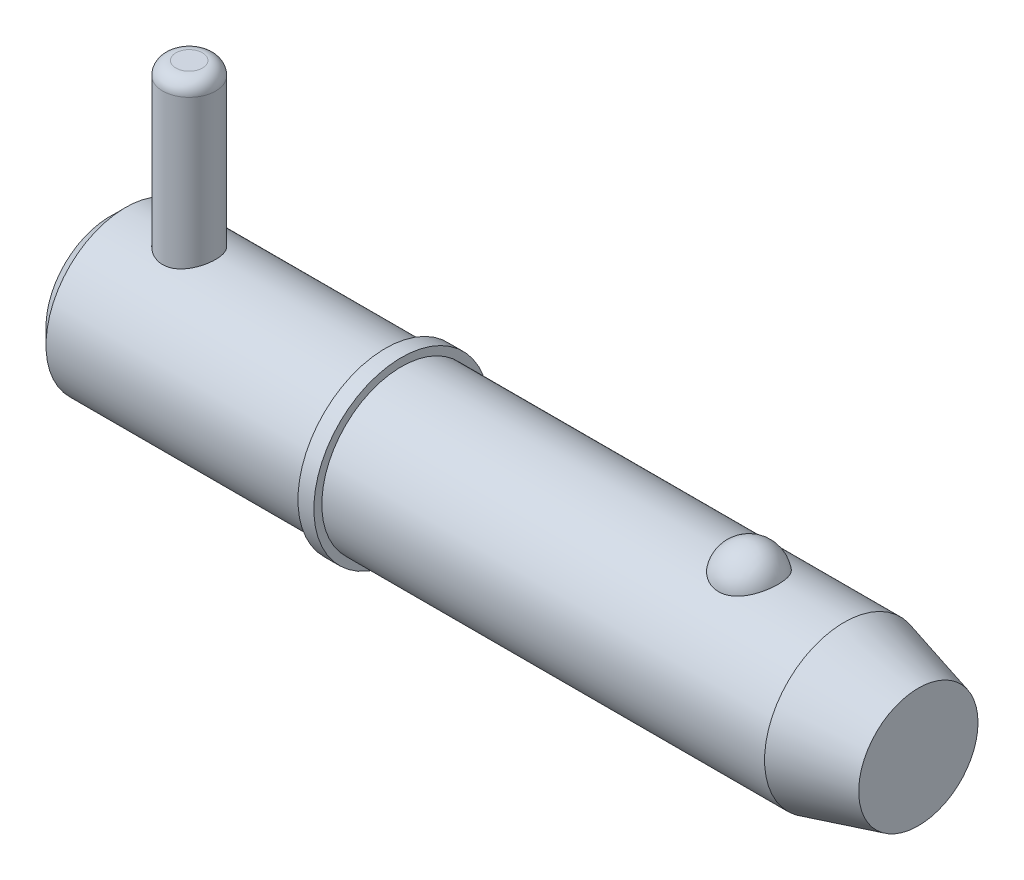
ISO-10303-21;
HEADER;
FILE_DESCRIPTION(('STEP AP214'),'2;1');
FILE_NAME('part.step','',(''),(''),'','','');
FILE_SCHEMA(('AUTOMOTIVE_DESIGN { 1 0 10303 214 1 1 1 1 }'));
ENDSEC;
DATA;
#1=APPLICATION_CONTEXT('core data for automotive mechanical design processes');
#2=APPLICATION_PROTOCOL_DEFINITION('international standard','automotive_design',2000,#1);
#3=PRODUCT_CONTEXT('',#1,'mechanical');
#4=PRODUCT('Part','Part','',(#3));
#5=PRODUCT_RELATED_PRODUCT_CATEGORY('part','',(#4));
#6=PRODUCT_DEFINITION_FORMATION('','',#4);
#7=PRODUCT_DEFINITION_CONTEXT('part definition',#1,'design');
#8=PRODUCT_DEFINITION('design','',#6,#7);
#9=PRODUCT_DEFINITION_SHAPE('','',#8);
#10=(LENGTH_UNIT() NAMED_UNIT(*) SI_UNIT(.MILLI.,.METRE.));
#11=(NAMED_UNIT(*) PLANE_ANGLE_UNIT() SI_UNIT($,.RADIAN.));
#12=(NAMED_UNIT(*) SI_UNIT($,.STERADIAN.) SOLID_ANGLE_UNIT());
#13=UNCERTAINTY_MEASURE_WITH_UNIT(LENGTH_MEASURE(1.E-05),#10,'distance_accuracy_value','');
#14=(GEOMETRIC_REPRESENTATION_CONTEXT(3) GLOBAL_UNCERTAINTY_ASSIGNED_CONTEXT((#13)) GLOBAL_UNIT_ASSIGNED_CONTEXT((#10,
#11,#12)) REPRESENTATION_CONTEXT('',''));
#15=CARTESIAN_POINT('',(0.,0.,0.));
#16=DIRECTION('',(0.,0.,1.));
#17=DIRECTION('',(1.,0.,0.));
#18=AXIS2_PLACEMENT_3D('',#15,#16,#17);
#19=CARTESIAN_POINT('',(9.52500000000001,28.575,0.));
#20=DIRECTION('',(0.,-1.,0.));
#21=DIRECTION('',(0.,0.,-1.));
#22=AXIS2_PLACEMENT_3D('',#19,#20,#21);
#23=CYLINDRICAL_SURFACE('',#22,3.175);
#24=CARTESIAN_POINT('',(9.52500000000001,-7.93750000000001,0.));
#25=DIRECTION('',(0.,1.,0.));
#26=DIRECTION('',(0.,0.,1.));
#27=AXIS2_PLACEMENT_3D('',#24,#25,#26);
#28=CIRCLE('',#27,3.175);
#29=CARTESIAN_POINT('',(9.52500000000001,-7.93750000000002,-3.175));
#30=VERTEX_POINT('',#29);
#31=EDGE_CURVE('P0_E25',#30,#30,#28,.T.);
#32=CARTESIAN_POINT('',(9.52500000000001,26.9875,0.));
#33=DIRECTION('',(0.,1.,0.));
#34=DIRECTION('',(0.,0.,1.));
#35=AXIS2_PLACEMENT_3D('',#32,#33,#34);
#36=CIRCLE('',#35,3.175);
#37=CARTESIAN_POINT('',(9.52500000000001,26.9875,-3.175));
#38=VERTEX_POINT('',#37);
#39=EDGE_CURVE('P0_E29',#38,#38,#36,.F.);
#40=CARTESIAN_POINT('',(9.52500000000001,-7.93750000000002,-3.175));
#41=CARTESIAN_POINT('',(9.52500000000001,-7.57369791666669,-3.175));
#42=CARTESIAN_POINT('',(9.52500000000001,-7.20989583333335,-3.175));
#43=CARTESIAN_POINT('',(9.52500000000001,-6.48229166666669,-3.175));
#44=CARTESIAN_POINT('',(9.52500000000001,-6.11848958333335,-3.175));
#45=CARTESIAN_POINT('',(9.52500000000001,-5.39088541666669,-3.175));
#46=CARTESIAN_POINT('',(9.52500000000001,-5.02708333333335,-3.175));
#47=CARTESIAN_POINT('',(9.52500000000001,-4.29947916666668,-3.175));
#48=CARTESIAN_POINT('',(9.52500000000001,-3.93567708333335,-3.175));
#49=CARTESIAN_POINT('',(9.52500000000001,-3.20807291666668,-3.175));
#50=CARTESIAN_POINT('',(9.52500000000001,-2.84427083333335,-3.175));
#51=CARTESIAN_POINT('',(9.52500000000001,-2.11666666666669,-3.175));
#52=CARTESIAN_POINT('',(9.52500000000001,-1.75286458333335,-3.175));
#53=CARTESIAN_POINT('',(9.52500000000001,-1.02526041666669,-3.175));
#54=CARTESIAN_POINT('',(9.52500000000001,-0.661458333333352,-3.175));
#55=CARTESIAN_POINT('',(9.52500000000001,0.0661458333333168,-3.175));
#56=CARTESIAN_POINT('',(9.52500000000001,0.429947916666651,-3.175));
#57=CARTESIAN_POINT('',(9.52500000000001,1.15755208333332,-3.175));
#58=CARTESIAN_POINT('',(9.52500000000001,1.52135416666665,-3.175));
#59=CARTESIAN_POINT('',(9.52500000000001,2.24895833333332,-3.175));
#60=CARTESIAN_POINT('',(9.52500000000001,2.61276041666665,-3.175));
#61=CARTESIAN_POINT('',(9.52500000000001,3.34036458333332,-3.175));
#62=CARTESIAN_POINT('',(9.52500000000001,3.70416666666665,-3.175));
#63=CARTESIAN_POINT('',(9.52500000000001,4.43177083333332,-3.175));
#64=CARTESIAN_POINT('',(9.52500000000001,4.79557291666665,-3.175));
#65=CARTESIAN_POINT('',(9.52500000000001,5.52317708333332,-3.175));
#66=CARTESIAN_POINT('',(9.52500000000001,5.88697916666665,-3.175));
#67=CARTESIAN_POINT('',(9.52500000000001,6.61458333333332,-3.175));
#68=CARTESIAN_POINT('',(9.52500000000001,6.97838541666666,-3.175));
#69=CARTESIAN_POINT('',(9.52500000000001,7.70598958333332,-3.175));
#70=CARTESIAN_POINT('',(9.52500000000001,8.06979166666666,-3.175));
#71=CARTESIAN_POINT('',(9.52500000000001,8.79739583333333,-3.175));
#72=CARTESIAN_POINT('',(9.52500000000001,9.16119791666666,-3.175));
#73=CARTESIAN_POINT('',(9.52500000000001,9.88880208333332,-3.175));
#74=CARTESIAN_POINT('',(9.52500000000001,10.2526041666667,-3.175));
#75=CARTESIAN_POINT('',(9.52500000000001,10.9802083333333,-3.175));
#76=CARTESIAN_POINT('',(9.52500000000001,11.3440104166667,-3.175));
#77=CARTESIAN_POINT('',(9.52500000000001,12.0716145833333,-3.175));
#78=CARTESIAN_POINT('',(9.52500000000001,12.4354166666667,-3.175));
#79=CARTESIAN_POINT('',(9.52500000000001,13.1630208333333,-3.175));
#80=CARTESIAN_POINT('',(9.52500000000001,13.5268229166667,-3.175));
#81=CARTESIAN_POINT('',(9.52500000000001,14.2544270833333,-3.175));
#82=CARTESIAN_POINT('',(9.52500000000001,14.6182291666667,-3.175));
#83=CARTESIAN_POINT('',(9.52500000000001,15.3458333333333,-3.175));
#84=CARTESIAN_POINT('',(9.52500000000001,15.7096354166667,-3.175));
#85=CARTESIAN_POINT('',(9.52500000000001,16.4372395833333,-3.175));
#86=CARTESIAN_POINT('',(9.52500000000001,16.8010416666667,-3.175));
#87=CARTESIAN_POINT('',(9.52500000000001,17.5286458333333,-3.175));
#88=CARTESIAN_POINT('',(9.52500000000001,17.8924479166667,-3.175));
#89=CARTESIAN_POINT('',(9.52500000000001,18.6200520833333,-3.175));
#90=CARTESIAN_POINT('',(9.52500000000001,18.9838541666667,-3.175));
#91=CARTESIAN_POINT('',(9.52500000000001,19.7114583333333,-3.175));
#92=CARTESIAN_POINT('',(9.52500000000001,20.0752604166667,-3.175));
#93=CARTESIAN_POINT('',(9.52500000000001,20.8028645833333,-3.175));
#94=CARTESIAN_POINT('',(9.52500000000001,21.1666666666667,-3.175));
#95=CARTESIAN_POINT('',(9.52500000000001,21.8942708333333,-3.175));
#96=CARTESIAN_POINT('',(9.52500000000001,22.2580729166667,-3.175));
#97=CARTESIAN_POINT('',(9.52500000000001,22.9856770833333,-3.175));
#98=CARTESIAN_POINT('',(9.52500000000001,23.3494791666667,-3.175));
#99=CARTESIAN_POINT('',(9.52500000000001,24.0770833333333,-3.175));
#100=CARTESIAN_POINT('',(9.52500000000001,24.4408854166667,-3.175));
#101=CARTESIAN_POINT('',(9.52500000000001,25.1684895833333,-3.175));
#102=CARTESIAN_POINT('',(9.52500000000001,25.5322916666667,-3.175));
#103=CARTESIAN_POINT('',(9.52500000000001,26.2598958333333,-3.175));
#104=CARTESIAN_POINT('',(9.52500000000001,26.6236979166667,-3.175));
#105=CARTESIAN_POINT('',(9.52500000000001,26.9875,-3.175));
#106=B_SPLINE_CURVE_WITH_KNOTS('',3,(#40,#41,#42,#43,#44,#45,#46,#47,#48,#49,#50,#51,#52,#53,
#54,#55,#56,#57,#58,#59,#60,#61,#62,#63,#64,#65,#66,#67,#68,#69,#70,#71,#72,#73,#74,#75,#76,#77,
#78,#79,#80,#81,#82,#83,#84,#85,#86,#87,#88,#89,#90,#91,#92,#93,#94,#95,#96,#97,#98,#99,#100,
#101,#102,#103,#104,#105),.UNSPECIFIED.,.F.,.F.,(4,2,2,2,2,2,2,2,2,2,2,2,2,2,2,2,2,2,2,2,2,2,2,
2,2,2,2,2,2,2,2,2,4),(0.,1.09140625,2.1828125,3.27421875,4.365625,5.45703125,6.5484375,
7.63984375,8.73125000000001,9.82265625,10.9140625,12.00546875,13.096875,14.18828125,15.2796875,
16.37109375,17.4625,18.55390625,19.6453125,20.73671875,21.828125,22.91953125,24.0109375,
25.10234375,26.19375,27.28515625,28.3765625,29.46796875,30.559375,31.65078125,32.7421875,
33.83359375,34.925),.UNSPECIFIED.);
#107=EDGE_CURVE('P0_BSEAM14',#30,#38,#106,.T.);
#108=ORIENTED_EDGE('',*,*,#31,.T.);
#109=ORIENTED_EDGE('',*,*,#39,.T.);
#110=ORIENTED_EDGE('',*,*,#107,.T.);
#111=ORIENTED_EDGE('',*,*,#107,.F.);
#112=EDGE_LOOP('',(#108,#110,#109,#111));
#113=FACE_BOUND('',#112,.T.);
#114=ADVANCED_FACE('P0_F14',(#113),#23,.T.);
#115=CARTESIAN_POINT('',(9.52500000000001,28.575,0.));
#116=DIRECTION('',(0.,1.,0.));
#117=DIRECTION('',(0.,0.,1.));
#118=AXIS2_PLACEMENT_3D('',#115,#116,#117);
#119=PLANE('',#118);
#120=CARTESIAN_POINT('',(9.52500000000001,28.575,0.));
#121=DIRECTION('',(0.,1.,0.));
#122=DIRECTION('',(0.,0.,1.));
#123=AXIS2_PLACEMENT_3D('',#120,#121,#122);
#124=CIRCLE('',#123,1.5875);
#125=CARTESIAN_POINT('',(9.52500000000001,28.575,1.5875));
#126=VERTEX_POINT('',#125);
#127=EDGE_CURVE('P0_E10',#126,#126,#124,.T.);
#128=ORIENTED_EDGE('',*,*,#127,.T.);
#129=EDGE_LOOP('',(#128));
#130=FACE_BOUND('',#129,.T.);
#131=ADVANCED_FACE('P0_F46',(#130),#119,.T.);
#132=CARTESIAN_POINT('',(9.52500000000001,-9.525,0.));
#133=DIRECTION('',(0.,1.,0.));
#134=DIRECTION('',(0.,0.,1.));
#135=AXIS2_PLACEMENT_3D('',#132,#133,#134);
#136=PLANE('',#135);
#137=CARTESIAN_POINT('',(9.52500000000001,-9.525,0.));
#138=DIRECTION('',(0.,1.,0.));
#139=DIRECTION('',(0.,0.,1.));
#140=AXIS2_PLACEMENT_3D('',#137,#138,#139);
#141=CIRCLE('',#140,1.5875);
#142=CARTESIAN_POINT('',(9.52500000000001,-9.525,1.5875));
#143=VERTEX_POINT('',#142);
#144=EDGE_CURVE('P0_E21',#143,#143,#141,.F.);
#145=ORIENTED_EDGE('',*,*,#144,.T.);
#146=EDGE_LOOP('',(#145));
#147=FACE_BOUND('',#146,.T.);
#148=ADVANCED_FACE('P0_F43',(#147),#136,.F.);
#149=CARTESIAN_POINT('',(9.52500000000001,-7.9375,0.));
#150=DIRECTION('',(0.,1.,0.));
#151=DIRECTION('',(0.,0.,1.));
#152=AXIS2_PLACEMENT_3D('',#149,#150,#151);
#153=DEGENERATE_TOROIDAL_SURFACE('',#152,1.5875,1.5875,.T.);
#154=ORIENTED_EDGE('',*,*,#144,.F.);
#155=EDGE_LOOP('',(#154));
#156=FACE_BOUND('',#155,.T.);
#157=ORIENTED_EDGE('',*,*,#31,.F.);
#158=EDGE_LOOP('',(#157));
#159=FACE_BOUND('',#158,.T.);
#160=ADVANCED_FACE('P0_F38',(#156,#159),#153,.T.);
#161=CARTESIAN_POINT('',(9.52500000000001,26.9875,0.));
#162=DIRECTION('',(0.,1.,0.));
#163=DIRECTION('',(0.,0.,1.));
#164=AXIS2_PLACEMENT_3D('',#161,#162,#163);
#165=DEGENERATE_TOROIDAL_SURFACE('',#164,1.5875,1.5875,.T.);
#166=ORIENTED_EDGE('',*,*,#39,.F.);
#167=EDGE_LOOP('',(#166));
#168=FACE_BOUND('',#167,.T.);
#169=ORIENTED_EDGE('',*,*,#127,.F.);
#170=EDGE_LOOP('',(#169));
#171=FACE_BOUND('',#170,.T.);
#172=ADVANCED_FACE('P0_F16',(#168,#171),#165,.T.);
#173=CLOSED_SHELL('',(#114,#131,#148,#160,#172));
#174=MANIFOLD_SOLID_BREP('P0_B1',#173);
#175=CARTESIAN_POINT('',(0.,0.,0.));
#176=DIRECTION('',(1.,0.,0.));
#177=DIRECTION('',(0.,0.,-1.));
#178=AXIS2_PLACEMENT_3D('',#175,#176,#177);
#179=CYLINDRICAL_SURFACE('',#178,9.525);
#180=CARTESIAN_POINT('',(87.9430540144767,0.,0.));
#181=DIRECTION('',(1.,0.,0.));
#182=DIRECTION('',(0.,0.,-1.));
#183=AXIS2_PLACEMENT_3D('',#180,#181,#182);
#184=CIRCLE('',#183,9.525);
#185=CARTESIAN_POINT('',(87.9430540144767,0.,-9.525));
#186=VERTEX_POINT('',#185);
#187=EDGE_CURVE('P1_E81',#186,#186,#184,.T.);
#188=ORIENTED_EDGE('',*,*,#187,.F.);
#189=EDGE_LOOP('',(#188));
#190=FACE_BOUND('',#189,.T.);
#191=CARTESIAN_POINT('',(34.93,0.,0.));
#192=DIRECTION('',(1.,0.,0.));
#193=DIRECTION('',(0.,0.,-1.));
#194=AXIS2_PLACEMENT_3D('',#191,#192,#193);
#195=CIRCLE('',#194,9.525);
#196=CARTESIAN_POINT('',(34.93,0.,-9.525));
#197=VERTEX_POINT('',#196);
#198=EDGE_CURVE('P1_E85',#197,#197,#195,.T.);
#199=ORIENTED_EDGE('',*,*,#198,.T.);
#200=EDGE_LOOP('',(#199));
#201=FACE_BOUND('',#200,.T.);
#202=CARTESIAN_POINT('',(76.5457573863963,8.80405803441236,3.63513233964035));
#203=CARTESIAN_POINT('',(76.4516766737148,8.80405953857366,3.63513053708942));
#204=CARTESIAN_POINT('',(76.3575618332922,8.80561325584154,3.6313746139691));
#205=CARTESIAN_POINT('',(76.1700126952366,8.81177748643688,3.61638665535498));
#206=CARTESIAN_POINT('',(76.0765788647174,8.81638992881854,3.60514990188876));
#207=CARTESIAN_POINT('',(75.7979452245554,8.8346711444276,3.56024627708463));
#208=CARTESIAN_POINT('',(75.6146916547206,8.85278327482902,3.51538626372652));
#209=CARTESIAN_POINT('',(75.259509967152,8.89871214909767,3.39742145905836));
#210=CARTESIAN_POINT('',(75.0875533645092,8.92650327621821,3.32439116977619));
#211=CARTESIAN_POINT('',(74.758707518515,8.98874819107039,3.15220244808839));
#212=CARTESIAN_POINT('',(74.6018114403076,9.02319893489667,3.05305594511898));
#213=CARTESIAN_POINT('',(74.3022147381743,9.09629186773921,2.82797815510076));
#214=CARTESIAN_POINT('',(74.1600600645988,9.13502685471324,2.7013513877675));
#215=CARTESIAN_POINT('',(73.8982999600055,9.2118657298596,2.4264193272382));
#216=CARTESIAN_POINT('',(73.7787015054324,9.2499694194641,2.27810735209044));
#217=CARTESIAN_POINT('',(73.559645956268,9.3234108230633,1.95652290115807));
#218=CARTESIAN_POINT('',(73.4613174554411,9.35855090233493,1.78243511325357));
#219=CARTESIAN_POINT('',(73.2938190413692,9.42045142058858,1.41937246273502));
#220=CARTESIAN_POINT('',(73.2246511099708,9.44721128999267,1.23039658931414));
#221=CARTESIAN_POINT('',(73.1161994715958,9.48990641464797,0.840370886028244));
#222=CARTESIAN_POINT('',(73.0772880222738,9.50570658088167,0.639202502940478));
#223=CARTESIAN_POINT('',(73.0315550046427,9.52433146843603,0.232664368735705));
#224=CARTESIAN_POINT('',(73.0247324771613,9.52715657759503,0.0272947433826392));
#225=CARTESIAN_POINT('',(73.043255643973,9.51956918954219,-0.380478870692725));
#226=CARTESIAN_POINT('',(73.0684052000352,9.50923740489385,-0.582893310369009));
#227=CARTESIAN_POINT('',(73.1500253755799,9.47651897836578,-0.980293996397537));
#228=CARTESIAN_POINT('',(73.2064966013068,9.45413210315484,-1.17528009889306));
#229=CARTESIAN_POINT('',(73.3497192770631,9.39954044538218,-1.55263697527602));
#230=CARTESIAN_POINT('',(73.4365124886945,9.36732213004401,-1.73498993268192));
#231=CARTESIAN_POINT('',(73.6386103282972,9.29640700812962,-2.08177763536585));
#232=CARTESIAN_POINT('',(73.7539172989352,9.25770966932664,-2.24621090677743));
#233=CARTESIAN_POINT('',(74.011264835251,9.17775604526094,-2.5533833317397));
#234=CARTESIAN_POINT('',(74.1534344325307,9.136488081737,-2.696011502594));
#235=CARTESIAN_POINT('',(74.46089985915,9.05620497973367,-2.95451229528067));
#236=CARTESIAN_POINT('',(74.626193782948,9.01718965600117,-3.07038711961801));
#237=CARTESIAN_POINT('',(74.972052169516,8.9468001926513,-3.26976836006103));
#238=CARTESIAN_POINT('',(75.1522278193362,8.91528408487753,-3.35389750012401));
#239=CARTESIAN_POINT('',(75.5256514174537,8.86272514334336,-3.49043503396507));
#240=CARTESIAN_POINT('',(75.7188944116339,8.8416783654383,-3.54285537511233));
#241=CARTESIAN_POINT('',(76.1025036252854,8.81348056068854,-3.61241306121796));
#242=CARTESIAN_POINT('',(76.2925251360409,8.80568348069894,-3.63119339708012));
#243=CARTESIAN_POINT('',(76.6731906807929,8.80289410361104,-3.63795342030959));
#244=CARTESIAN_POINT('',(76.8638345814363,8.80789922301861,-3.62593932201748));
#245=CARTESIAN_POINT('',(77.234007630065,8.8297491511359,-3.57238430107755));
#246=CARTESIAN_POINT('',(77.4136976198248,8.84621463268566,-3.53178890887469));
#247=CARTESIAN_POINT('',(77.763422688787,8.88875330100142,-3.42331083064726));
#248=CARTESIAN_POINT('',(77.9334569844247,8.91482726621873,-3.35542593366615));
#249=CARTESIAN_POINT('',(78.2632377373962,8.97448239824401,-3.19248225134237));
#250=CARTESIAN_POINT('',(78.4226801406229,9.00821446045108,-3.09686474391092));
#251=CARTESIAN_POINT('',(78.7235136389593,9.07935398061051,-2.88162736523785));
#252=CARTESIAN_POINT('',(78.8649005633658,9.11676228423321,-2.76200196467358));
#253=CARTESIAN_POINT('',(79.1333193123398,9.19347419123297,-2.49516285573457));
#254=CARTESIAN_POINT('',(79.2592750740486,9.23277872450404,-2.34686614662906));
#255=CARTESIAN_POINT('',(79.4855227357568,9.30737610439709,-2.03093683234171));
#256=CARTESIAN_POINT('',(79.5858100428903,9.34266823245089,-1.86330077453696));
#257=CARTESIAN_POINT('',(79.7615149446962,9.40674710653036,-1.50744893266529));
#258=CARTESIAN_POINT('',(79.836041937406,9.4352917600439,-1.31874876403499));
#259=CARTESIAN_POINT('',(79.9541650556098,9.48144132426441,-0.930631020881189));
#260=CARTESIAN_POINT('',(79.9977608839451,9.49904612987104,-0.731213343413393));
#261=CARTESIAN_POINT('',(80.0531580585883,9.5215314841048,-0.327147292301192));
#262=CARTESIAN_POINT('',(80.0649354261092,9.52640243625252,-0.122495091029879));
#263=CARTESIAN_POINT('',(80.0563825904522,9.52289571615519,0.286018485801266));
#264=CARTESIAN_POINT('',(80.0360530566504,9.51451832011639,0.489879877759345));
#265=CARTESIAN_POINT('',(79.9638840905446,9.48544083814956,0.889994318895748));
#266=CARTESIAN_POINT('',(79.9121993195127,9.46480124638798,1.08627971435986));
#267=CARTESIAN_POINT('',(79.7784917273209,9.41333895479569,1.46682086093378));
#268=CARTESIAN_POINT('',(79.6964668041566,9.38251554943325,1.65107577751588));
#269=CARTESIAN_POINT('',(79.5031929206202,9.31365636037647,2.00346348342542));
#270=CARTESIAN_POINT('',(79.3917838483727,9.27558138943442,2.17150083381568));
#271=CARTESIAN_POINT('',(79.1422947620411,9.19638714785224,2.48563115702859));
#272=CARTESIAN_POINT('',(79.0042163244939,9.15526805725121,2.63172542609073));
#273=CARTESIAN_POINT('',(78.7048438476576,9.07465393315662,2.89750997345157));
#274=CARTESIAN_POINT('',(78.5436109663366,9.03515496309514,3.01726776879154));
#275=CARTESIAN_POINT('',(78.2016136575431,8.96227564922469,3.22732920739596));
#276=CARTESIAN_POINT('',(78.020841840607,8.92889763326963,3.31762165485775));
#277=CARTESIAN_POINT('',(77.6514451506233,8.8734538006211,3.46314419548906));
#278=CARTESIAN_POINT('',(77.4633237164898,8.85102983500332,3.51950082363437));
#279=CARTESIAN_POINT('',(77.1757869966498,8.8266696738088,3.57993683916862));
#280=CARTESIAN_POINT('',(77.0791339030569,8.82009725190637,3.59606217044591));
#281=CARTESIAN_POINT('',(76.8846770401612,8.81020897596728,3.62022512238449));
#282=CARTESIAN_POINT('',(76.7868741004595,8.80689090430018,3.62826825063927));
#283=CARTESIAN_POINT('',(76.6412243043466,8.80445615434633,3.63416760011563));
#284=CARTESIAN_POINT('',(76.5934952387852,8.80405727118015,3.63513325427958));
#285=CARTESIAN_POINT('',(76.5457573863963,8.80405803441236,3.63513233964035));
#286=B_SPLINE_CURVE_WITH_KNOTS('',3,(#202,#203,#204,#205,#206,#207,#208,#209,#210,#211,#212,
#213,#214,#215,#216,#217,#218,#219,#220,#221,#222,#223,#224,#225,#226,#227,#228,#229,#230,#231,
#232,#233,#234,#235,#236,#237,#238,#239,#240,#241,#242,#243,#244,#245,#246,#247,#248,#249,#250,
#251,#252,#253,#254,#255,#256,#257,#258,#259,#260,#261,#262,#263,#264,#265,#266,#267,#268,#269,
#270,#271,#272,#273,#274,#275,#276,#277,#278,#279,#280,#281,#282,#283,#284,#285),.UNSPECIFIED.,
.T.,.F.,(4,2,2,2,2,2,2,2,2,2,2,2,2,2,2,2,2,2,2,2,2,2,2,2,2,2,2,2,2,2,2,2,2,2,2,2,2,2,2,2,2,4),
(0.,0.282202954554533,0.564584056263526,1.13017050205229,1.69427128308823,2.258114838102,
2.83836627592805,3.41879688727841,4.02497117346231,4.63118665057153,5.24474754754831,
5.85829010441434,6.46808687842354,7.07789545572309,7.68854723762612,8.29924920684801,
8.91296283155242,9.52662591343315,10.1275338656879,10.7282152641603,11.2986646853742,
11.868998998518,12.4213015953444,12.973648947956,13.5380053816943,14.1024919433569,
14.695298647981,15.2882113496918,15.8999469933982,16.5116885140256,17.1238909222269,
17.7360805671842,18.3452748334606,18.9545113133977,19.567138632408,20.1797297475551,
20.7907316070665,21.4019653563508,21.9915938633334,22.2859053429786,22.5800161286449,
22.723209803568),.UNSPECIFIED.);
#287=CARTESIAN_POINT('',(76.5457573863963,8.80405803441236,3.63513233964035));
#288=VERTEX_POINT('',#287);
#289=EDGE_CURVE('P1_E35',#288,#288,#286,.T.);
#290=ORIENTED_EDGE('',*,*,#289,.T.);
#291=EDGE_LOOP('',(#290));
#292=FACE_BOUND('',#291,.T.);
#293=ADVANCED_FACE('P1_F13',(#190,#201,#292),#179,.T.);
#294=CARTESIAN_POINT('',(0.,0.,0.));
#295=DIRECTION('',(-1.,0.,0.));
#296=DIRECTION('',(0.,0.,1.));
#297=AXIS2_PLACEMENT_3D('',#294,#295,#296);
#298=PLANE('',#297);
#299=CARTESIAN_POINT('',(0.,0.,0.));
#300=DIRECTION('',(1.,0.,0.));
#301=DIRECTION('',(0.,0.,-1.));
#302=AXIS2_PLACEMENT_3D('',#299,#300,#301);
#303=CIRCLE('',#302,7.62);
#304=CARTESIAN_POINT('',(0.,0.,-7.62));
#305=VERTEX_POINT('',#304);
#306=EDGE_CURVE('P1_E9',#305,#305,#303,.T.);
#307=ORIENTED_EDGE('',*,*,#306,.F.);
#308=EDGE_LOOP('',(#307));
#309=FACE_BOUND('',#308,.T.);
#310=ADVANCED_FACE('P1_F15',(#309),#298,.T.);
#311=CARTESIAN_POINT('',(1.90499999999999,0.,0.));
#312=DIRECTION('',(1.,0.,0.));
#313=DIRECTION('',(0.,0.,-1.));
#314=AXIS2_PLACEMENT_3D('',#311,#312,#313);
#315=CONICAL_SURFACE('',#314,9.525,0.785398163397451);
#316=ORIENTED_EDGE('',*,*,#306,.T.);
#317=EDGE_LOOP('',(#316));
#318=FACE_BOUND('',#317,.T.);
#319=CARTESIAN_POINT('',(1.90499999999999,0.,0.));
#320=DIRECTION('',(1.,0.,0.));
#321=DIRECTION('',(0.,0.,-1.));
#322=AXIS2_PLACEMENT_3D('',#319,#320,#321);
#323=CIRCLE('',#322,9.525);
#324=CARTESIAN_POINT('',(1.90499999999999,0.,-9.525));
#325=VERTEX_POINT('',#324);
#326=EDGE_CURVE('P1_E26',#325,#325,#323,.T.);
#327=ORIENTED_EDGE('',*,*,#326,.F.);
#328=EDGE_LOOP('',(#327));
#329=FACE_BOUND('',#328,.T.);
#330=ADVANCED_FACE('P1_F77',(#318,#329),#315,.T.);
#331=CARTESIAN_POINT('',(0.,0.,0.));
#332=DIRECTION('',(1.,0.,0.));
#333=DIRECTION('',(0.,0.,-1.));
#334=AXIS2_PLACEMENT_3D('',#331,#332,#333);
#335=CYLINDRICAL_SURFACE('',#334,9.525);
#336=CARTESIAN_POINT('',(9.525,-8.98025612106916,3.175));
#337=CARTESIAN_POINT('',(9.35206354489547,-8.98025555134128,3.17500081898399));
#338=CARTESIAN_POINT('',(9.17913201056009,-8.98530617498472,3.16082293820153));
#339=CARTESIAN_POINT('',(8.83839221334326,-9.00485797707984,3.10467734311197));
#340=CARTESIAN_POINT('',(8.67058479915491,-9.0193607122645,3.06270505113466));
#341=CARTESIAN_POINT('',(8.34508461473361,-9.05599546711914,2.95260866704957));
#342=CARTESIAN_POINT('',(8.18737272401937,-9.07811252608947,2.88453582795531));
#343=CARTESIAN_POINT('',(7.88555684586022,-9.12746212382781,2.72434567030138));
#344=CARTESIAN_POINT('',(7.74145587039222,-9.1546957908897,2.63222304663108));
#345=CARTESIAN_POINT('',(7.46531411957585,-9.21240503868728,2.42268738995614));
#346=CARTESIAN_POINT('',(7.33388351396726,-9.24296141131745,2.30449228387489));
#347=CARTESIAN_POINT('',(7.09229340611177,-9.30319020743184,2.0478358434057));
#348=CARTESIAN_POINT('',(6.98213731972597,-9.33286248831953,1.90937126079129));
#349=CARTESIAN_POINT('',(6.78345450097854,-9.38891527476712,1.61164431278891));
#350=CARTESIAN_POINT('',(6.69556709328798,-9.41518969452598,1.45193356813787));
#351=CARTESIAN_POINT('',(6.54814671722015,-9.46053437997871,1.11896913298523));
#352=CARTESIAN_POINT('',(6.48860610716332,-9.47960658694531,0.945719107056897));
#353=CARTESIAN_POINT('',(6.40163866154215,-9.50782564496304,0.596991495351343));
#354=CARTESIAN_POINT('',(6.373166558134,-9.5172947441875,0.421801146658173));
#355=CARTESIAN_POINT('',(6.3458207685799,-9.52638456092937,0.068890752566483));
#356=CARTESIAN_POINT('',(6.34693945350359,-9.52600781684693,-0.108828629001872));
#357=CARTESIAN_POINT('',(6.37808050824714,-9.51566675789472,-0.454353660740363));
#358=CARTESIAN_POINT('',(6.4069675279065,-9.50607905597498,-0.622274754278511));
#359=CARTESIAN_POINT('',(6.490947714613,-9.47886621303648,-0.950732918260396));
#360=CARTESIAN_POINT('',(6.54604265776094,-9.46124052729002,-1.11126948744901));
#361=CARTESIAN_POINT('',(6.68153768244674,-9.41945253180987,-1.42288410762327));
#362=CARTESIAN_POINT('',(6.76226085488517,-9.3952073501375,-1.57381010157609));
#363=CARTESIAN_POINT('',(6.94645456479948,-9.34270397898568,-1.86030973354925));
#364=CARTESIAN_POINT('',(7.04993142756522,-9.31444467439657,-1.99587908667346));
#365=CARTESIAN_POINT('',(7.28241619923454,-9.25532159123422,-2.2545702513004));
#366=CARTESIAN_POINT('',(7.4123967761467,-9.22439783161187,-2.37680549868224));
#367=CARTESIAN_POINT('',(7.69127470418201,-9.1645528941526,-2.5980302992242));
#368=CARTESIAN_POINT('',(7.84017496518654,-9.13563202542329,-2.6970162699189));
#369=CARTESIAN_POINT('',(8.15547526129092,-9.08273917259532,-2.87016016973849));
#370=CARTESIAN_POINT('',(8.32209451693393,-9.05884361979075,-2.94394402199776));
#371=CARTESIAN_POINT('',(8.66638917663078,-9.01959241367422,-3.06210713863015));
#372=CARTESIAN_POINT('',(8.84405991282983,-9.00423318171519,-3.10649872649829));
#373=CARTESIAN_POINT('',(9.19682677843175,-8.98460345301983,-3.16281207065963));
#374=CARTESIAN_POINT('',(9.37167742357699,-8.9798639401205,-3.17610837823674));
#375=CARTESIAN_POINT('',(9.72113927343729,-8.9806993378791,-3.17374726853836));
#376=CARTESIAN_POINT('',(9.89575051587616,-8.98627237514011,-3.15809511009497));
#377=CARTESIAN_POINT('',(10.2335233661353,-9.00663737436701,-3.09951644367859));
#378=CARTESIAN_POINT('',(10.3968722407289,-9.02110608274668,-3.05754530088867));
#379=CARTESIAN_POINT('',(10.7141759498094,-9.05727657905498,-2.94866651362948));
#380=CARTESIAN_POINT('',(10.8681291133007,-9.07897964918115,-2.88175444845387));
#381=CARTESIAN_POINT('',(11.1676828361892,-9.12802586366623,-2.72248103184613));
#382=CARTESIAN_POINT('',(11.3128635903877,-9.1555260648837,-2.62937980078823));
#383=CARTESIAN_POINT('',(11.5860387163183,-9.21276315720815,-2.42120937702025));
#384=CARTESIAN_POINT('',(11.7140280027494,-9.24250070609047,-2.30613370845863));
#385=CARTESIAN_POINT('',(11.9555513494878,-9.30259247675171,-2.05070616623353));
#386=CARTESIAN_POINT('',(12.0680936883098,-9.33290753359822,-1.90940458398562));
#387=CARTESIAN_POINT('',(12.267933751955,-9.3893275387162,-1.60917665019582));
#388=CARTESIAN_POINT('',(12.3552323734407,-9.41543263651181,-1.45025092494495));
#389=CARTESIAN_POINT('',(12.5013088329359,-9.46036988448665,-1.12007606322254));
#390=CARTESIAN_POINT('',(12.5602723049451,-9.47924920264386,-0.9489158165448));
#391=CARTESIAN_POINT('',(12.6483355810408,-9.50781089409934,-0.598355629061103));
#392=CARTESIAN_POINT('',(12.6774461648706,-9.5174965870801,-0.4189586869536));
#393=CARTESIAN_POINT('',(12.7040070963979,-9.52632915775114,-0.066088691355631));
#394=CARTESIAN_POINT('',(12.7028811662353,-9.52594996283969,0.107266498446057));
#395=CARTESIAN_POINT('',(12.6725130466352,-9.51586223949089,0.451202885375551));
#396=CARTESIAN_POINT('',(12.643273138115,-9.50615446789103,0.621784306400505));
#397=CARTESIAN_POINT('',(12.5584514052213,-9.47867404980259,0.952633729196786));
#398=CARTESIAN_POINT('',(12.5032953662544,-9.46103195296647,1.1130225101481));
#399=CARTESIAN_POINT('',(12.3686013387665,-9.41949985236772,1.42233126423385));
#400=CARTESIAN_POINT('',(12.2890589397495,-9.39560871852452,1.57124915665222));
#401=CARTESIAN_POINT('',(12.1044667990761,-9.34294133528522,1.85938800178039));
#402=CARTESIAN_POINT('',(11.9985831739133,-9.31401720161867,1.9980473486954));
#403=CARTESIAN_POINT('',(11.7657327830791,-9.25490239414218,2.25609475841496));
#404=CARTESIAN_POINT('',(11.6387592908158,-9.22471131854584,2.37547664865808));
#405=CARTESIAN_POINT('',(11.3613902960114,-9.16505913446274,2.59633024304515));
#406=CARTESIAN_POINT('',(11.2102725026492,-9.13567286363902,2.69691791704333));
#407=CARTESIAN_POINT('',(10.8923631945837,-9.08241113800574,2.87119803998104));
#408=CARTESIAN_POINT('',(10.7255757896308,-9.05853424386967,2.94489751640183));
#409=CARTESIAN_POINT('',(10.3887212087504,-9.02021736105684,3.06020415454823));
#410=CARTESIAN_POINT('',(10.219143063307,-9.00539959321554,3.10311136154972));
#411=CARTESIAN_POINT('',(9.87470703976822,-8.98542092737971,3.16050396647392));
#412=CARTESIAN_POINT('',(9.699851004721,-8.98025669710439,3.17499917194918));
#413=CARTESIAN_POINT('',(9.525,-8.98025612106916,3.175));
#414=B_SPLINE_CURVE_WITH_KNOTS('',3,(#336,#337,#338,#339,#340,#341,#342,#343,#344,#345,#346,
#347,#348,#349,#350,#351,#352,#353,#354,#355,#356,#357,#358,#359,#360,#361,#362,#363,#364,#365,
#366,#367,#368,#369,#370,#371,#372,#373,#374,#375,#376,#377,#378,#379,#380,#381,#382,#383,#384,
#385,#386,#387,#388,#389,#390,#391,#392,#393,#394,#395,#396,#397,#398,#399,#400,#401,#402,#403,
#404,#405,#406,#407,#408,#409,#410,#411,#412,#413),.UNSPECIFIED.,.T.,.F.,(4,2,2,2,2,2,2,2,2,2,2,
2,2,2,2,2,2,2,2,2,2,2,2,2,2,2,2,2,2,2,2,2,2,2,2,2,2,2,4),(0.,0.518161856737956,1.03640907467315,
1.55364379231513,2.07099270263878,2.60671746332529,3.14252816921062,3.69231882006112,
4.24196117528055,4.77247962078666,5.30286129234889,5.81244090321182,6.32205505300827,
6.83836754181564,7.3548237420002,7.89559553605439,8.43645060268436,8.98501631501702,
9.53335188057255,10.056948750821,10.5804505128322,11.0859695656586,11.5915782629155,
12.1132237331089,12.6350231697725,13.1819271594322,13.7288117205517,14.2720628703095,
14.815117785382,15.3326491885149,15.8501386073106,16.3594083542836,16.868770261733,
17.3969527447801,17.925304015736,18.4743376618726,19.023227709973,19.5473069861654,
20.0712053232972),.UNSPECIFIED.);
#415=CARTESIAN_POINT('',(9.525,-8.98025612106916,3.175));
#416=VERTEX_POINT('',#415);
#417=EDGE_CURVE('P1_E17',#416,#416,#414,.T.);
#418=ORIENTED_EDGE('',*,*,#417,.F.);
#419=EDGE_LOOP('',(#418));
#420=FACE_BOUND('',#419,.T.);
#421=CARTESIAN_POINT('',(9.525,8.98025612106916,3.175));
#422=CARTESIAN_POINT('',(9.69793645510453,8.98025555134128,3.17500081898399));
#423=CARTESIAN_POINT('',(9.87086798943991,8.98530617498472,3.16082293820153));
#424=CARTESIAN_POINT('',(10.2116077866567,9.00485797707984,3.10467734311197));
#425=CARTESIAN_POINT('',(10.3794152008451,9.0193607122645,3.06270505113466));
#426=CARTESIAN_POINT('',(10.7049153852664,9.05599546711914,2.95260866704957));
#427=CARTESIAN_POINT('',(10.8626272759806,9.07811252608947,2.88453582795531));
#428=CARTESIAN_POINT('',(11.1644431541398,9.12746212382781,2.72434567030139));
#429=CARTESIAN_POINT('',(11.3085441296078,9.15469579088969,2.63222304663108));
#430=CARTESIAN_POINT('',(11.5846858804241,9.21240503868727,2.42268738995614));
#431=CARTESIAN_POINT('',(11.7161164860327,9.24296141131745,2.30449228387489));
#432=CARTESIAN_POINT('',(11.9577065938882,9.30319020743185,2.0478358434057));
#433=CARTESIAN_POINT('',(12.067862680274,9.33286248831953,1.90937126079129));
#434=CARTESIAN_POINT('',(12.2665454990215,9.38891527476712,1.61164431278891));
#435=CARTESIAN_POINT('',(12.354432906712,9.41518969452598,1.45193356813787));
#436=CARTESIAN_POINT('',(12.5018532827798,9.46053437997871,1.11896913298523));
#437=CARTESIAN_POINT('',(12.5613938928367,9.47960658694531,0.945719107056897));
#438=CARTESIAN_POINT('',(12.6483613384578,9.50782564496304,0.596991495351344));
#439=CARTESIAN_POINT('',(12.676833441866,9.5172947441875,0.421801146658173));
#440=CARTESIAN_POINT('',(12.7041792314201,9.52638456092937,0.0688907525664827));
#441=CARTESIAN_POINT('',(12.7030605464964,9.52600781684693,-0.108828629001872));
#442=CARTESIAN_POINT('',(12.6719194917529,9.51566675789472,-0.454353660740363));
#443=CARTESIAN_POINT('',(12.6430324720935,9.50607905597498,-0.622274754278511));
#444=CARTESIAN_POINT('',(12.559052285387,9.47886621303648,-0.950732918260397));
#445=CARTESIAN_POINT('',(12.5039573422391,9.46124052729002,-1.11126948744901));
#446=CARTESIAN_POINT('',(12.3684623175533,9.41945253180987,-1.42288410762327));
#447=CARTESIAN_POINT('',(12.2877391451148,9.3952073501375,-1.57381010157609));
#448=CARTESIAN_POINT('',(12.1035454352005,9.34270397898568,-1.86030973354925));
#449=CARTESIAN_POINT('',(12.0000685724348,9.31444467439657,-1.99587908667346));
#450=CARTESIAN_POINT('',(11.7675838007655,9.25532159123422,-2.2545702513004));
#451=CARTESIAN_POINT('',(11.6376032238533,9.22439783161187,-2.37680549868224));
#452=CARTESIAN_POINT('',(11.358725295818,9.1645528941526,-2.5980302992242));
#453=CARTESIAN_POINT('',(11.2098250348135,9.13563202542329,-2.6970162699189));
#454=CARTESIAN_POINT('',(10.8945247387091,9.08273917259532,-2.87016016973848));
#455=CARTESIAN_POINT('',(10.7279054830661,9.05884361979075,-2.94394402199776));
#456=CARTESIAN_POINT('',(10.3836108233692,9.01959241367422,-3.06210713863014));
#457=CARTESIAN_POINT('',(10.2059400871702,9.00423318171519,-3.10649872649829));
#458=CARTESIAN_POINT('',(9.85317322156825,8.98460345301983,-3.16281207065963));
#459=CARTESIAN_POINT('',(9.67832257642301,8.9798639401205,-3.17610837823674));
#460=CARTESIAN_POINT('',(9.32886072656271,8.9806993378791,-3.17374726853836));
#461=CARTESIAN_POINT('',(9.15424948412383,8.98627237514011,-3.15809511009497));
#462=CARTESIAN_POINT('',(8.81647663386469,9.00663737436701,-3.09951644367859));
#463=CARTESIAN_POINT('',(8.65312775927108,9.02110608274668,-3.05754530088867));
#464=CARTESIAN_POINT('',(8.33582405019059,9.05727657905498,-2.94866651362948));
#465=CARTESIAN_POINT('',(8.18187088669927,9.07897964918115,-2.88175444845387));
#466=CARTESIAN_POINT('',(7.88231716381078,9.12802586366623,-2.72248103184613));
#467=CARTESIAN_POINT('',(7.73713640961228,9.1555260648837,-2.62937980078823));
#468=CARTESIAN_POINT('',(7.46396128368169,9.21276315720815,-2.42120937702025));
#469=CARTESIAN_POINT('',(7.33597199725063,9.24250070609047,-2.30613370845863));
#470=CARTESIAN_POINT('',(7.09444865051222,9.30259247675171,-2.05070616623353));
#471=CARTESIAN_POINT('',(6.98190631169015,9.33290753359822,-1.90940458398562));
#472=CARTESIAN_POINT('',(6.78206624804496,9.3893275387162,-1.60917665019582));
#473=CARTESIAN_POINT('',(6.6947676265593,9.41543263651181,-1.45025092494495));
#474=CARTESIAN_POINT('',(6.54869116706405,9.46036988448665,-1.12007606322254));
#475=CARTESIAN_POINT('',(6.48972769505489,9.47924920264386,-0.948915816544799));
#476=CARTESIAN_POINT('',(6.40166441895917,9.50781089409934,-0.598355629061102));
#477=CARTESIAN_POINT('',(6.3725538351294,9.5174965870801,-0.418958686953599));
#478=CARTESIAN_POINT('',(6.34599290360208,9.52632915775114,-0.0660886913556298));
#479=CARTESIAN_POINT('',(6.3471188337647,9.52594996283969,0.107266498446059));
#480=CARTESIAN_POINT('',(6.37748695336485,9.51586223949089,0.451202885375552));
#481=CARTESIAN_POINT('',(6.40672686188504,9.50615446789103,0.621784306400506));
#482=CARTESIAN_POINT('',(6.49154859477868,9.47867404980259,0.952633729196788));
#483=CARTESIAN_POINT('',(6.54670463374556,9.46103195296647,1.11302251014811));
#484=CARTESIAN_POINT('',(6.68139866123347,9.41949985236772,1.42233126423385));
#485=CARTESIAN_POINT('',(6.76094106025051,9.39560871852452,1.57124915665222));
#486=CARTESIAN_POINT('',(6.94553320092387,9.34294133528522,1.85938800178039));
#487=CARTESIAN_POINT('',(7.05141682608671,9.31401720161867,1.9980473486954));
#488=CARTESIAN_POINT('',(7.28426721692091,9.25490239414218,2.25609475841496));
#489=CARTESIAN_POINT('',(7.41124070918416,9.22471131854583,2.37547664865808));
#490=CARTESIAN_POINT('',(7.68860970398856,9.16505913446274,2.59633024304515));
#491=CARTESIAN_POINT('',(7.83972749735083,9.13567286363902,2.69691791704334));
#492=CARTESIAN_POINT('',(8.15763680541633,9.08241113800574,2.87119803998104));
#493=CARTESIAN_POINT('',(8.32442421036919,9.05853424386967,2.94489751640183));
#494=CARTESIAN_POINT('',(8.66127879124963,9.02021736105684,3.06020415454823));
#495=CARTESIAN_POINT('',(8.83085693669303,9.00539959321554,3.10311136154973));
#496=CARTESIAN_POINT('',(9.17529296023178,8.98542092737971,3.16050396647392));
#497=CARTESIAN_POINT('',(9.350148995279,8.98025669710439,3.17499917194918));
#498=CARTESIAN_POINT('',(9.525,8.98025612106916,3.175));
#499=B_SPLINE_CURVE_WITH_KNOTS('',3,(#421,#422,#423,#424,#425,#426,#427,#428,#429,#430,#431,
#432,#433,#434,#435,#436,#437,#438,#439,#440,#441,#442,#443,#444,#445,#446,#447,#448,#449,#450,
#451,#452,#453,#454,#455,#456,#457,#458,#459,#460,#461,#462,#463,#464,#465,#466,#467,#468,#469,
#470,#471,#472,#473,#474,#475,#476,#477,#478,#479,#480,#481,#482,#483,#484,#485,#486,#487,#488,
#489,#490,#491,#492,#493,#494,#495,#496,#497,#498),.UNSPECIFIED.,.T.,.F.,(4,2,2,2,2,2,2,2,2,2,2,
2,2,2,2,2,2,2,2,2,2,2,2,2,2,2,2,2,2,2,2,2,2,2,2,2,2,2,4),(0.,0.518161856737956,1.03640907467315,
1.55364379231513,2.07099270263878,2.60671746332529,3.14252816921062,3.69231882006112,
4.24196117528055,4.77247962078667,5.30286129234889,5.81244090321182,6.32205505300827,
6.83836754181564,7.3548237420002,7.89559553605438,8.43645060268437,8.98501631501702,
9.53335188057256,10.056948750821,10.5804505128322,11.0859695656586,11.5915782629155,
12.1132237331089,12.6350231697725,13.1819271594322,13.7288117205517,14.2720628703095,
14.815117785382,15.3326491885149,15.8501386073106,16.3594083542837,16.868770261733,
17.3969527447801,17.9253040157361,18.4743376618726,19.023227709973,19.5473069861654,
20.0712053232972),.UNSPECIFIED.);
#500=CARTESIAN_POINT('',(9.525,8.98025612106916,3.175));
#501=VERTEX_POINT('',#500);
#502=EDGE_CURVE('P1_E43',#501,#501,#499,.T.);
#503=ORIENTED_EDGE('',*,*,#502,.F.);
#504=EDGE_LOOP('',(#503));
#505=FACE_BOUND('',#504,.T.);
#506=ORIENTED_EDGE('',*,*,#326,.T.);
#507=EDGE_LOOP('',(#506));
#508=FACE_BOUND('',#507,.T.);
#509=CARTESIAN_POINT('',(33.025,0.,0.));
#510=DIRECTION('',(1.,0.,0.));
#511=DIRECTION('',(0.,0.,-1.));
#512=AXIS2_PLACEMENT_3D('',#509,#510,#511);
#513=CIRCLE('',#512,9.525);
#514=CARTESIAN_POINT('',(33.025,0.,-9.525));
#515=VERTEX_POINT('',#514);
#516=EDGE_CURVE('P1_E31',#515,#515,#513,.T.);
#517=ORIENTED_EDGE('',*,*,#516,.F.);
#518=EDGE_LOOP('',(#517));
#519=FACE_BOUND('',#518,.T.);
#520=ADVANCED_FACE('P1_F103',(#420,#505,#508,#519),#335,.T.);
#521=CARTESIAN_POINT('',(33.025,9.525,0.));
#522=DIRECTION('',(-1.,0.,0.));
#523=DIRECTION('',(0.,0.,1.));
#524=AXIS2_PLACEMENT_3D('',#521,#522,#523);
#525=PLANE('',#524);
#526=ORIENTED_EDGE('',*,*,#516,.T.);
#527=EDGE_LOOP('',(#526));
#528=FACE_BOUND('',#527,.T.);
#529=CARTESIAN_POINT('',(33.025,0.,0.));
#530=DIRECTION('',(1.,0.,0.));
#531=DIRECTION('',(0.,0.,-1.));
#532=AXIS2_PLACEMENT_3D('',#529,#530,#531);
#533=CIRCLE('',#532,10.4775);
#534=CARTESIAN_POINT('',(33.025,0.,-10.4775));
#535=VERTEX_POINT('',#534);
#536=EDGE_CURVE('P1_E91',#535,#535,#533,.T.);
#537=ORIENTED_EDGE('',*,*,#536,.F.);
#538=EDGE_LOOP('',(#537));
#539=FACE_BOUND('',#538,.T.);
#540=ADVANCED_FACE('P1_F100',(#528,#539),#525,.T.);
#541=CARTESIAN_POINT('',(0.,0.,0.));
#542=DIRECTION('',(1.,0.,0.));
#543=DIRECTION('',(0.,0.,-1.));
#544=AXIS2_PLACEMENT_3D('',#541,#542,#543);
#545=CYLINDRICAL_SURFACE('',#544,10.4775);
#546=ORIENTED_EDGE('',*,*,#536,.T.);
#547=EDGE_LOOP('',(#546));
#548=FACE_BOUND('',#547,.T.);
#549=CARTESIAN_POINT('',(34.93,0.,0.));
#550=DIRECTION('',(1.,0.,0.));
#551=DIRECTION('',(0.,0.,-1.));
#552=AXIS2_PLACEMENT_3D('',#549,#550,#551);
#553=CIRCLE('',#552,10.4775);
#554=CARTESIAN_POINT('',(34.93,0.,-10.4775));
#555=VERTEX_POINT('',#554);
#556=EDGE_CURVE('P1_E88',#555,#555,#553,.T.);
#557=ORIENTED_EDGE('',*,*,#556,.F.);
#558=EDGE_LOOP('',(#557));
#559=FACE_BOUND('',#558,.T.);
#560=ADVANCED_FACE('P1_F68',(#548,#559),#545,.T.);
#561=CARTESIAN_POINT('',(34.93,10.4775,0.));
#562=DIRECTION('',(1.,0.,0.));
#563=DIRECTION('',(0.,0.,-1.));
#564=AXIS2_PLACEMENT_3D('',#561,#562,#563);
#565=PLANE('',#564);
#566=ORIENTED_EDGE('',*,*,#556,.T.);
#567=EDGE_LOOP('',(#566));
#568=FACE_BOUND('',#567,.T.);
#569=ORIENTED_EDGE('',*,*,#198,.F.);
#570=EDGE_LOOP('',(#569));
#571=FACE_BOUND('',#570,.T.);
#572=ADVANCED_FACE('P1_F62',(#568,#571),#565,.T.);
#573=CARTESIAN_POINT('',(96.83,0.,0.));
#574=DIRECTION('',(-1.,0.,0.));
#575=DIRECTION('',(0.,0.,1.));
#576=AXIS2_PLACEMENT_3D('',#573,#574,#575);
#577=CONICAL_SURFACE('',#576,7.14375000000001,0.26179938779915);
#578=ORIENTED_EDGE('',*,*,#187,.T.);
#579=EDGE_LOOP('',(#578));
#580=FACE_BOUND('',#579,.T.);
#581=CARTESIAN_POINT('',(96.83,0.,0.));
#582=DIRECTION('',(1.,0.,0.));
#583=DIRECTION('',(0.,0.,-1.));
#584=AXIS2_PLACEMENT_3D('',#581,#582,#583);
#585=CIRCLE('',#584,7.14375000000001);
#586=CARTESIAN_POINT('',(96.83,0.,-7.14375000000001));
#587=VERTEX_POINT('',#586);
#588=EDGE_CURVE('P1_E42',#587,#587,#585,.T.);
#589=ORIENTED_EDGE('',*,*,#588,.F.);
#590=EDGE_LOOP('',(#589));
#591=FACE_BOUND('',#590,.T.);
#592=ADVANCED_FACE('P1_F59',(#580,#591),#577,.T.);
#593=CARTESIAN_POINT('',(96.83,7.14375000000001,0.));
#594=DIRECTION('',(1.,0.,0.));
#595=DIRECTION('',(0.,0.,-1.));
#596=AXIS2_PLACEMENT_3D('',#593,#594,#595);
#597=PLANE('',#596);
#598=ORIENTED_EDGE('',*,*,#588,.T.);
#599=EDGE_LOOP('',(#598));
#600=FACE_BOUND('',#599,.T.);
#601=ADVANCED_FACE('P1_F55',(#600),#597,.T.);
#602=CARTESIAN_POINT('',(76.5457573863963,8.57249999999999,0.));
#603=DIRECTION('',(-1.,0.,0.));
#604=DIRECTION('',(0.,1.,0.));
#605=AXIS2_PLACEMENT_3D('',#602,#603,#604);
#606=SPHERICAL_SURFACE('',#605,3.64250000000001);
#607=ORIENTED_EDGE('',*,*,#289,.F.);
#608=EDGE_LOOP('',(#607));
#609=FACE_BOUND('',#608,.T.);
#610=ADVANCED_FACE('P1_F50',(#609),#606,.T.);
#611=CARTESIAN_POINT('',(9.525,-10.4775,0.));
#612=DIRECTION('',(0.,1.,0.));
#613=DIRECTION('',(0.,0.,1.));
#614=AXIS2_PLACEMENT_3D('',#611,#612,#613);
#615=CYLINDRICAL_SURFACE('',#614,3.175);
#616=ORIENTED_EDGE('',*,*,#417,.T.);
#617=EDGE_LOOP('',(#616));
#618=FACE_BOUND('',#617,.T.);
#619=ORIENTED_EDGE('',*,*,#502,.T.);
#620=EDGE_LOOP('',(#619));
#621=FACE_BOUND('',#620,.T.);
#622=ADVANCED_FACE('P1_F54',(#618,#621),#615,.F.);
#623=CLOSED_SHELL('',(#293,#310,#330,#520,#540,#560,#572,#592,#601,#610,#622));
#624=MANIFOLD_SOLID_BREP('P1_B1',#623);
#625=ADVANCED_BREP_SHAPE_REPRESENTATION('',(#18,#174,#624),#14);
#626=SHAPE_DEFINITION_REPRESENTATION(#9,#625);
ENDSEC;
END-ISO-10303-21;
